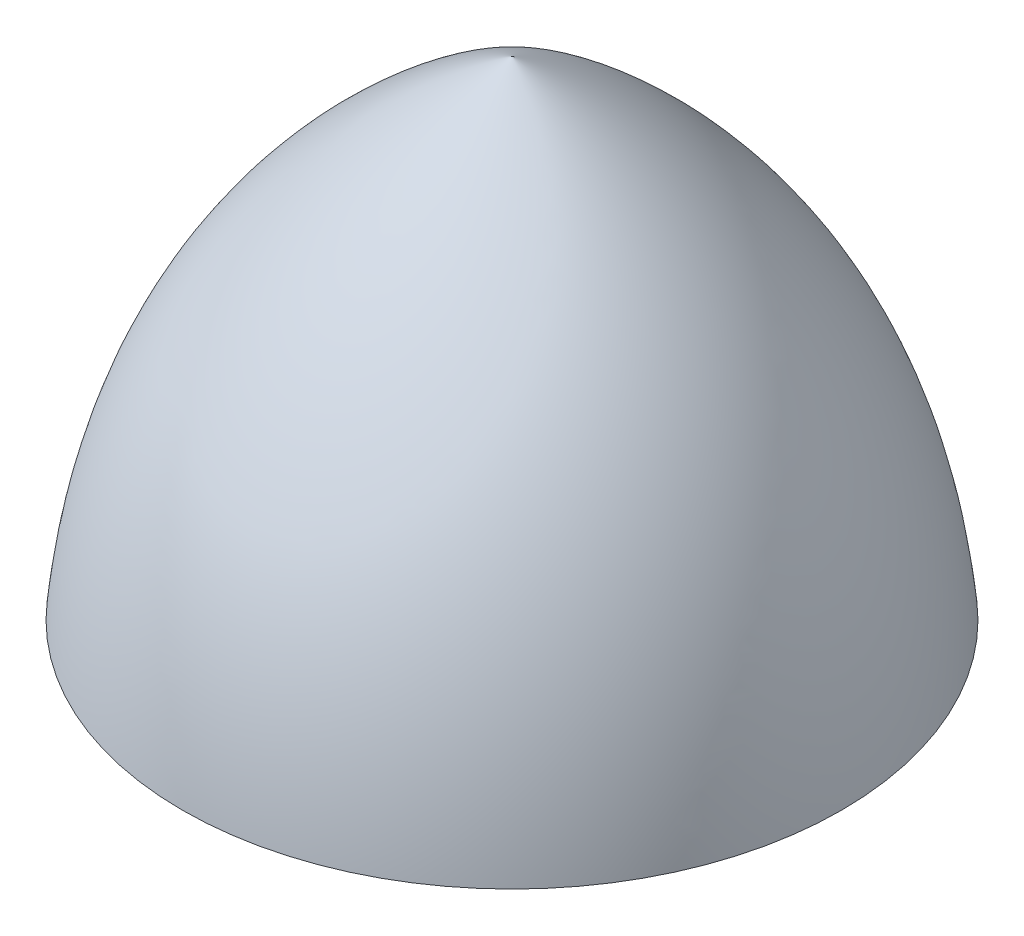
from build123d import *


with BuildPart() as part:
    # Croquis2 → Revoluci_n1 (revolve)
    with BuildSketch(Plane.XY):
        with BuildLine():
            Line((-23, -2.884509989), (-21, -2.884509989))
            add(Edge.make_bspline(
                [(-21, -2.884509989), (-19.921490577, 17.4257626), (-2, 26.223800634)],
                knots=[0, 0, 0, 1, 1, 1], degree=2))
            Line((-2, 26.223800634), (-2, 28.223800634))
            add(Edge.make_bspline(
                [(-23, -2.884509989), (-20.993793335, 18.322010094), (-2, 28.223800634)],
                knots=[0, 0, 0, 1, 1, 1], degree=2))
        make_face()
    revolve(axis=Axis((-2, 26.223800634, 0), (0, 1, 0)))


solid = part.part
